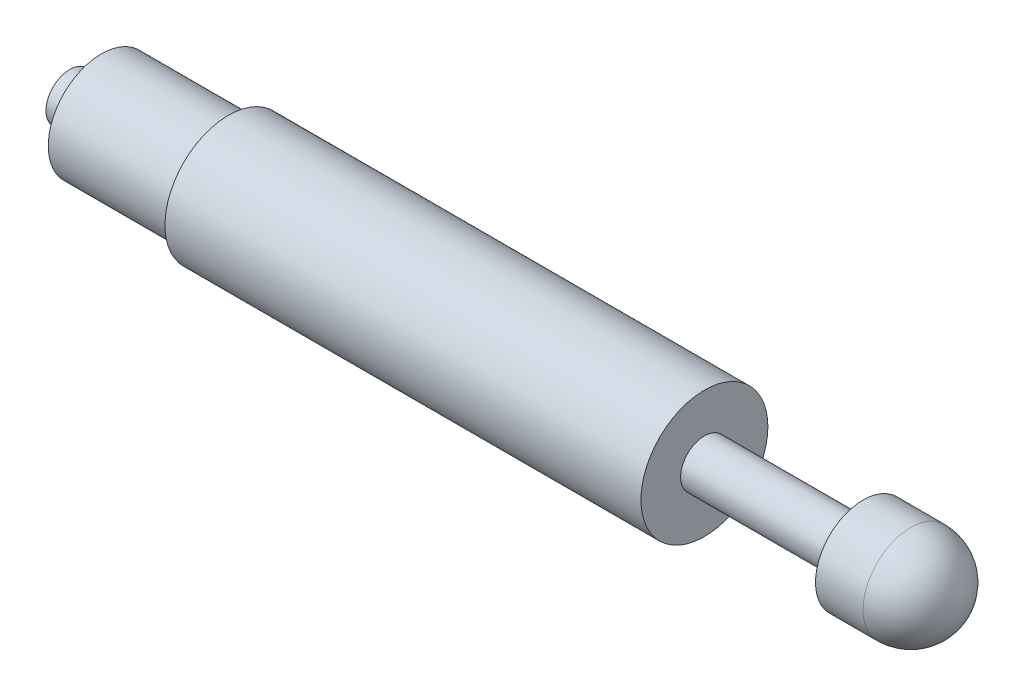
ISO-10303-21;
HEADER;
FILE_DESCRIPTION(('STEP AP214'),'2;1');
FILE_NAME('part.step','',(''),(''),'','','');
FILE_SCHEMA(('AUTOMOTIVE_DESIGN { 1 0 10303 214 1 1 1 1 }'));
ENDSEC;
DATA;
#1=APPLICATION_CONTEXT('core data for automotive mechanical design processes');
#2=APPLICATION_PROTOCOL_DEFINITION('international standard','automotive_design',2000,#1);
#3=PRODUCT_CONTEXT('',#1,'mechanical');
#4=PRODUCT('Part','Part','',(#3));
#5=PRODUCT_RELATED_PRODUCT_CATEGORY('part','',(#4));
#6=PRODUCT_DEFINITION_FORMATION('','',#4);
#7=PRODUCT_DEFINITION_CONTEXT('part definition',#1,'design');
#8=PRODUCT_DEFINITION('design','',#6,#7);
#9=PRODUCT_DEFINITION_SHAPE('','',#8);
#10=(LENGTH_UNIT() NAMED_UNIT(*) SI_UNIT(.MILLI.,.METRE.));
#11=(NAMED_UNIT(*) PLANE_ANGLE_UNIT() SI_UNIT($,.RADIAN.));
#12=(NAMED_UNIT(*) SI_UNIT($,.STERADIAN.) SOLID_ANGLE_UNIT());
#13=UNCERTAINTY_MEASURE_WITH_UNIT(LENGTH_MEASURE(1.E-05),#10,'distance_accuracy_value','');
#14=(GEOMETRIC_REPRESENTATION_CONTEXT(3) GLOBAL_UNCERTAINTY_ASSIGNED_CONTEXT((#13)) GLOBAL_UNIT_ASSIGNED_CONTEXT((#10,
#11,#12)) REPRESENTATION_CONTEXT('',''));
#15=CARTESIAN_POINT('',(0.,0.,0.));
#16=DIRECTION('',(0.,0.,1.));
#17=DIRECTION('',(1.,0.,0.));
#18=AXIS2_PLACEMENT_3D('',#15,#16,#17);
#19=CARTESIAN_POINT('',(-50.,0.,0.));
#20=DIRECTION('',(-1.,0.,0.));
#21=DIRECTION('',(0.,0.,1.));
#22=AXIS2_PLACEMENT_3D('',#19,#20,#21);
#23=PLANE('',#22);
#24=CARTESIAN_POINT('',(-50.,0.,0.));
#25=DIRECTION('',(1.,0.,0.));
#26=DIRECTION('',(0.,0.,-1.));
#27=AXIS2_PLACEMENT_3D('',#24,#25,#26);
#28=CIRCLE('',#27,1.5);
#29=CARTESIAN_POINT('',(-50.,0.,-1.5));
#30=VERTEX_POINT('',#29);
#31=EDGE_CURVE('E20',#30,#30,#28,.T.);
#32=ORIENTED_EDGE('',*,*,#31,.F.);
#33=EDGE_LOOP('',(#32));
#34=FACE_BOUND('',#33,.T.);
#35=ADVANCED_FACE('F17',(#34),#23,.T.);
#36=CARTESIAN_POINT('',(3.,0.,0.));
#37=DIRECTION('',(1.,0.,0.));
#38=DIRECTION('',(0.,0.,-1.));
#39=AXIS2_PLACEMENT_3D('',#36,#37,#38);
#40=SPHERICAL_SURFACE('',#39,3.);
#41=CARTESIAN_POINT('',(6.,0.,0.));
#42=VERTEX_POINT('',#41);
#43=VERTEX_LOOP('',#42);
#44=FACE_BOUND('',#43,.T.);
#45=CARTESIAN_POINT('',(3.,0.,0.));
#46=DIRECTION('',(-1.,0.,0.));
#47=DIRECTION('',(0.,0.,1.));
#48=AXIS2_PLACEMENT_3D('',#45,#46,#47);
#49=CIRCLE('',#48,3.);
#50=CARTESIAN_POINT('',(3.,0.,3.));
#51=VERTEX_POINT('',#50);
#52=EDGE_CURVE('E34',#51,#51,#49,.T.);
#53=ORIENTED_EDGE('',*,*,#52,.F.);
#54=EDGE_LOOP('',(#53));
#55=FACE_BOUND('',#54,.T.);
#56=ADVANCED_FACE('F28',(#44,#55),#40,.T.);
#57=CARTESIAN_POINT('',(-50.,0.,0.));
#58=DIRECTION('',(1.,0.,0.));
#59=DIRECTION('',(0.,0.,-1.));
#60=AXIS2_PLACEMENT_3D('',#57,#58,#59);
#61=CYLINDRICAL_SURFACE('',#60,1.5);
#62=CARTESIAN_POINT('',(-48.,0.,0.));
#63=DIRECTION('',(1.,0.,0.));
#64=DIRECTION('',(0.,0.,-1.));
#65=AXIS2_PLACEMENT_3D('',#62,#63,#64);
#66=CIRCLE('',#65,1.5);
#67=CARTESIAN_POINT('',(-48.,0.,-1.5));
#68=VERTEX_POINT('',#67);
#69=EDGE_CURVE('E36',#68,#68,#66,.T.);
#70=ORIENTED_EDGE('',*,*,#69,.F.);
#71=EDGE_LOOP('',(#70));
#72=FACE_BOUND('',#71,.T.);
#73=ORIENTED_EDGE('',*,*,#31,.T.);
#74=EDGE_LOOP('',(#73));
#75=FACE_BOUND('',#74,.T.);
#76=ADVANCED_FACE('F31',(#72,#75),#61,.T.);
#77=CARTESIAN_POINT('',(6.,0.,0.));
#78=DIRECTION('',(-1.,0.,0.));
#79=DIRECTION('',(0.,0.,1.));
#80=AXIS2_PLACEMENT_3D('',#77,#78,#79);
#81=CYLINDRICAL_SURFACE('',#80,3.);
#82=ORIENTED_EDGE('',*,*,#52,.T.);
#83=EDGE_LOOP('',(#82));
#84=FACE_BOUND('',#83,.T.);
#85=CARTESIAN_POINT('',(0.,0.,0.));
#86=DIRECTION('',(-1.,0.,0.));
#87=DIRECTION('',(0.,0.,1.));
#88=AXIS2_PLACEMENT_3D('',#85,#86,#87);
#89=CIRCLE('',#88,3.);
#90=CARTESIAN_POINT('',(0.,0.,3.));
#91=VERTEX_POINT('',#90);
#92=EDGE_CURVE('E39',#91,#91,#89,.F.);
#93=ORIENTED_EDGE('',*,*,#92,.T.);
#94=EDGE_LOOP('',(#93));
#95=FACE_BOUND('',#94,.T.);
#96=ADVANCED_FACE('F47',(#84,#95),#81,.T.);
#97=CARTESIAN_POINT('',(-48.,0.,0.));
#98=DIRECTION('',(-1.,0.,0.));
#99=DIRECTION('',(0.,0.,1.));
#100=AXIS2_PLACEMENT_3D('',#97,#98,#99);
#101=PLANE('',#100);
#102=ORIENTED_EDGE('',*,*,#69,.T.);
#103=EDGE_LOOP('',(#102));
#104=FACE_BOUND('',#103,.T.);
#105=CARTESIAN_POINT('',(-48.,0.,0.));
#106=DIRECTION('',(1.,0.,0.));
#107=DIRECTION('',(0.,0.,-1.));
#108=AXIS2_PLACEMENT_3D('',#105,#106,#107);
#109=CIRCLE('',#108,3.35639839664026);
#110=CARTESIAN_POINT('',(-48.,0.,-3.35639839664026));
#111=VERTEX_POINT('',#110);
#112=EDGE_CURVE('E96',#111,#111,#109,.T.);
#113=ORIENTED_EDGE('',*,*,#112,.F.);
#114=EDGE_LOOP('',(#113));
#115=FACE_BOUND('',#114,.T.);
#116=ADVANCED_FACE('F51',(#104,#115),#101,.T.);
#117=CARTESIAN_POINT('',(0.,0.,0.));
#118=DIRECTION('',(1.,0.,0.));
#119=DIRECTION('',(0.,0.,-1.));
#120=AXIS2_PLACEMENT_3D('',#117,#118,#119);
#121=PLANE('',#120);
#122=CARTESIAN_POINT('',(0.,0.,0.));
#123=DIRECTION('',(1.,0.,0.));
#124=DIRECTION('',(0.,0.,-1.));
#125=AXIS2_PLACEMENT_3D('',#122,#123,#124);
#126=CIRCLE('',#125,1.5);
#127=CARTESIAN_POINT('',(0.,0.,-1.5));
#128=VERTEX_POINT('',#127);
#129=EDGE_CURVE('E93',#128,#128,#126,.F.);
#130=ORIENTED_EDGE('',*,*,#129,.F.);
#131=EDGE_LOOP('',(#130));
#132=FACE_BOUND('',#131,.T.);
#133=ORIENTED_EDGE('',*,*,#92,.F.);
#134=EDGE_LOOP('',(#133));
#135=FACE_BOUND('',#134,.T.);
#136=ADVANCED_FACE('F54',(#132,#135),#121,.F.);
#137=CARTESIAN_POINT('',(-48.,0.,0.));
#138=DIRECTION('',(1.,0.,0.));
#139=DIRECTION('',(0.,0.,-1.));
#140=AXIS2_PLACEMENT_3D('',#137,#138,#139);
#141=CYLINDRICAL_SURFACE('',#140,3.35639839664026);
#142=CARTESIAN_POINT('',(-40.,0.,0.));
#143=DIRECTION('',(1.,0.,0.));
#144=DIRECTION('',(0.,0.,-1.));
#145=AXIS2_PLACEMENT_3D('',#142,#143,#144);
#146=CIRCLE('',#145,3.35639839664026);
#147=CARTESIAN_POINT('',(-40.,0.,-3.35639839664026));
#148=VERTEX_POINT('',#147);
#149=EDGE_CURVE('E88',#148,#148,#146,.T.);
#150=ORIENTED_EDGE('',*,*,#149,.F.);
#151=EDGE_LOOP('',(#150));
#152=FACE_BOUND('',#151,.T.);
#153=ORIENTED_EDGE('',*,*,#112,.T.);
#154=EDGE_LOOP('',(#153));
#155=FACE_BOUND('',#154,.T.);
#156=ADVANCED_FACE('F58',(#152,#155),#141,.T.);
#157=CARTESIAN_POINT('',(-10.,0.,0.));
#158=DIRECTION('',(1.,0.,0.));
#159=DIRECTION('',(0.,0.,-1.));
#160=AXIS2_PLACEMENT_3D('',#157,#158,#159);
#161=CYLINDRICAL_SURFACE('',#160,1.5);
#162=CARTESIAN_POINT('',(-10.,0.,0.));
#163=DIRECTION('',(1.,0.,0.));
#164=DIRECTION('',(0.,0.,-1.));
#165=AXIS2_PLACEMENT_3D('',#162,#163,#164);
#166=CIRCLE('',#165,1.5);
#167=CARTESIAN_POINT('',(-10.,0.,-1.5));
#168=VERTEX_POINT('',#167);
#169=EDGE_CURVE('E86',#168,#168,#166,.T.);
#170=ORIENTED_EDGE('',*,*,#169,.T.);
#171=EDGE_LOOP('',(#170));
#172=FACE_BOUND('',#171,.T.);
#173=ORIENTED_EDGE('',*,*,#129,.T.);
#174=EDGE_LOOP('',(#173));
#175=FACE_BOUND('',#174,.T.);
#176=ADVANCED_FACE('F62',(#172,#175),#161,.T.);
#177=CARTESIAN_POINT('',(-40.,0.,0.));
#178=DIRECTION('',(-1.,0.,0.));
#179=DIRECTION('',(0.,0.,1.));
#180=AXIS2_PLACEMENT_3D('',#177,#178,#179);
#181=PLANE('',#180);
#182=ORIENTED_EDGE('',*,*,#149,.T.);
#183=EDGE_LOOP('',(#182));
#184=FACE_BOUND('',#183,.T.);
#185=CARTESIAN_POINT('',(-40.,0.,0.));
#186=DIRECTION('',(1.,0.,0.));
#187=DIRECTION('',(0.,0.,-1.));
#188=AXIS2_PLACEMENT_3D('',#185,#186,#187);
#189=CIRCLE('',#188,4.);
#190=CARTESIAN_POINT('',(-40.,0.,-4.));
#191=VERTEX_POINT('',#190);
#192=EDGE_CURVE('E24',#191,#191,#189,.T.);
#193=ORIENTED_EDGE('',*,*,#192,.F.);
#194=EDGE_LOOP('',(#193));
#195=FACE_BOUND('',#194,.T.);
#196=ADVANCED_FACE('F66',(#184,#195),#181,.T.);
#197=CARTESIAN_POINT('',(-10.,0.,0.));
#198=DIRECTION('',(-1.,0.,0.));
#199=DIRECTION('',(0.,0.,1.));
#200=AXIS2_PLACEMENT_3D('',#197,#198,#199);
#201=PLANE('',#200);
#202=ORIENTED_EDGE('',*,*,#169,.F.);
#203=EDGE_LOOP('',(#202));
#204=FACE_BOUND('',#203,.T.);
#205=CARTESIAN_POINT('',(-10.,0.,0.));
#206=DIRECTION('',(1.,0.,0.));
#207=DIRECTION('',(0.,0.,-1.));
#208=AXIS2_PLACEMENT_3D('',#205,#206,#207);
#209=CIRCLE('',#208,4.);
#210=CARTESIAN_POINT('',(-10.,0.,-4.));
#211=VERTEX_POINT('',#210);
#212=EDGE_CURVE('E11',#211,#211,#209,.F.);
#213=ORIENTED_EDGE('',*,*,#212,.F.);
#214=EDGE_LOOP('',(#213));
#215=FACE_BOUND('',#214,.T.);
#216=ADVANCED_FACE('F70',(#204,#215),#201,.F.);
#217=CARTESIAN_POINT('',(-40.,0.,0.));
#218=DIRECTION('',(1.,0.,0.));
#219=DIRECTION('',(0.,0.,-1.));
#220=AXIS2_PLACEMENT_3D('',#217,#218,#219);
#221=CYLINDRICAL_SURFACE('',#220,4.);
#222=ORIENTED_EDGE('',*,*,#212,.T.);
#223=EDGE_LOOP('',(#222));
#224=FACE_BOUND('',#223,.T.);
#225=ORIENTED_EDGE('',*,*,#192,.T.);
#226=EDGE_LOOP('',(#225));
#227=FACE_BOUND('',#226,.T.);
#228=ADVANCED_FACE('F74',(#224,#227),#221,.T.);
#229=CLOSED_SHELL('',(#35,#56,#76,#96,#116,#136,#156,#176,#196,#216,#228));
#230=MANIFOLD_SOLID_BREP('B1',#229);
#231=ADVANCED_BREP_SHAPE_REPRESENTATION('',(#18,#230),#14);
#232=SHAPE_DEFINITION_REPRESENTATION(#9,#231);
ENDSEC;
END-ISO-10303-21;
